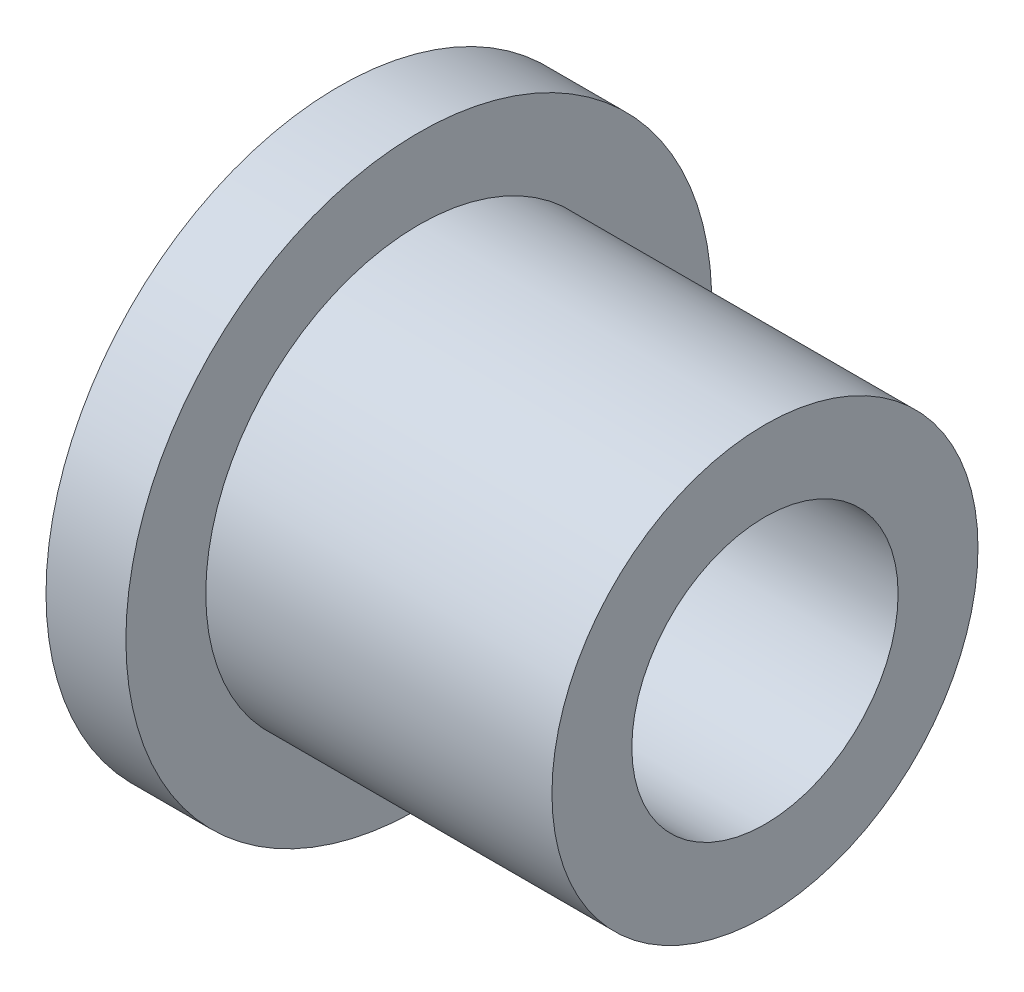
from build123d import *


with BuildPart() as part:
    # Esquisse1 → R_volution1 (revolve)
    with BuildSketch(Plane.XY, mode=Mode.PRIVATE) as r_volution1_sk:
        Polygon((0, 11), (0, 5), (16, 5), (16, 8), (3, 8), (3, 11), align=None)
    revolve(r_volution1_sk.sketch.rotate(Axis((-88.99, 0, 0), (1, 0, 0)), 90), axis=Axis((-88.99, 0, 0), (1, 0, 0)))


solid = part.part
